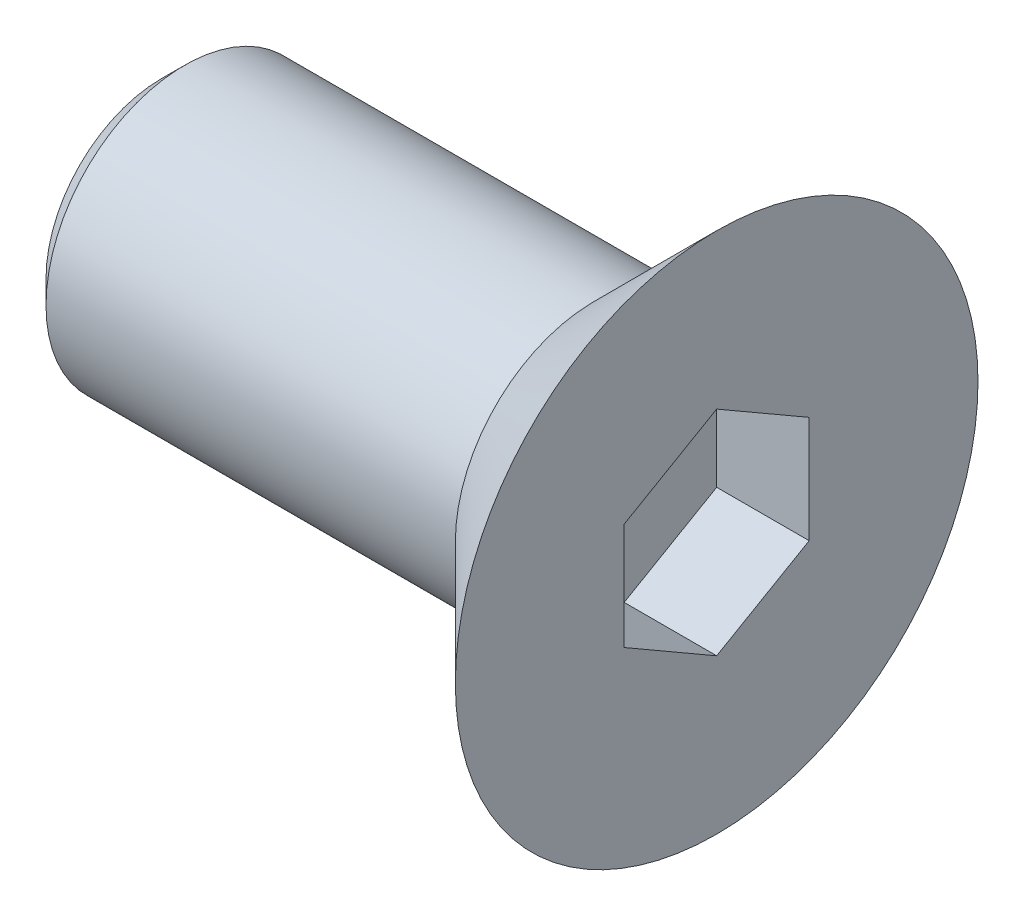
from build123d import *

# Parameters (mm, degrees)
CHANFREIN1_SIZE         = 0.5
ENL_V_MAT_EXTRU_1_DEPTH = 2


with BuildPart() as part:
    # Esquisse1 → R_volution1 (revolve)
    with BuildSketch(Plane.XY, mode=Mode.PRIVATE) as r_volution1_sk:
        Polygon((-2.745872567, 0), (-2.745872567, 5.65), (-5.395872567, 3), (-14.745872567, 3), (-14.745872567, 0), align=None)
    revolve(r_volution1_sk.sketch.rotate(Axis((-18.790332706, 0, 0), (1, 0, 0)), 90), axis=Axis((-18.790332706, 0, 0), (1, 0, 0)))

    # Chanfrein1
    chanfrein1_edges = [part.edges().sort_by_distance(p)[0] for p in [
        (-14.745872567, 0, -3),
    ]]
    chamfer(chanfrein1_edges, length=CHANFREIN1_SIZE)

    # Esquisse2 → Enl_v. mat.-Extru.1 (cut)
    with BuildSketch(Plane(origin=(-2.745872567, 0, 0), x_dir=(0, 0, -1), z_dir=(1, 0, 0))):
        Polygon((2, -1.154700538), (2, 1.154700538), (0, 2.309401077), (-2, 1.154700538), (-2, -1.154700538), (0, -2.309401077), align=None)
    extrude(amount=-ENL_V_MAT_EXTRU_1_DEPTH, mode=Mode.SUBTRACT)


solid = part.part
